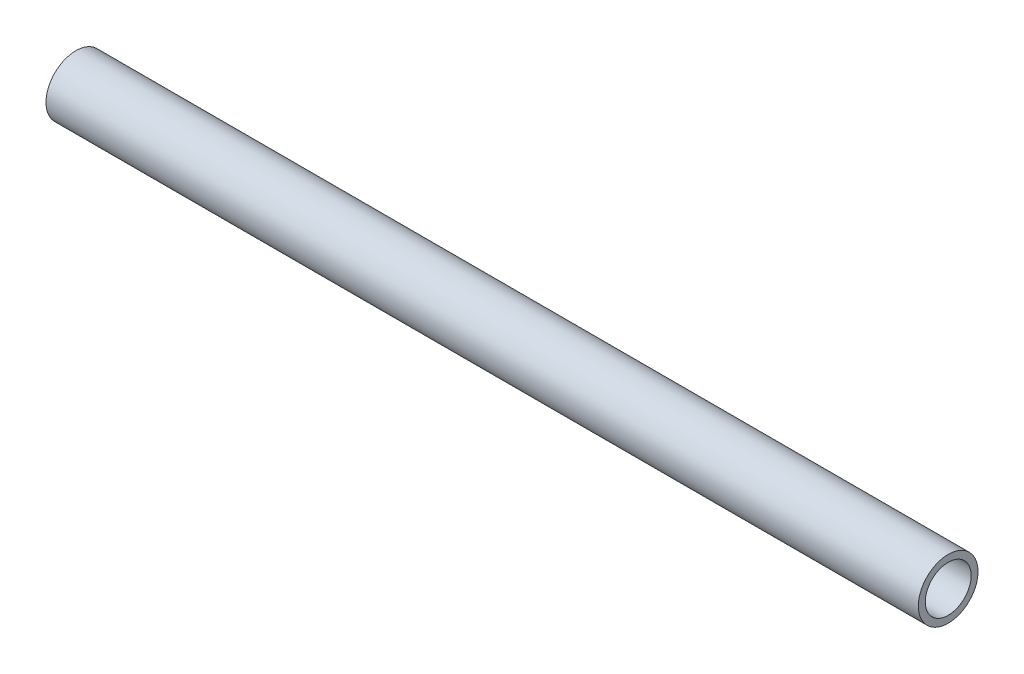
ISO-10303-21;
HEADER;
FILE_DESCRIPTION(('STEP AP214'),'2;1');
FILE_NAME('part.step','',(''),(''),'','','');
FILE_SCHEMA(('AUTOMOTIVE_DESIGN { 1 0 10303 214 1 1 1 1 }'));
ENDSEC;
DATA;
#1=APPLICATION_CONTEXT('core data for automotive mechanical design processes');
#2=APPLICATION_PROTOCOL_DEFINITION('international standard','automotive_design',2000,#1);
#3=PRODUCT_CONTEXT('',#1,'mechanical');
#4=PRODUCT('Part','Part','',(#3));
#5=PRODUCT_RELATED_PRODUCT_CATEGORY('part','',(#4));
#6=PRODUCT_DEFINITION_FORMATION('','',#4);
#7=PRODUCT_DEFINITION_CONTEXT('part definition',#1,'design');
#8=PRODUCT_DEFINITION('design','',#6,#7);
#9=PRODUCT_DEFINITION_SHAPE('','',#8);
#10=(LENGTH_UNIT() NAMED_UNIT(*) SI_UNIT(.MILLI.,.METRE.));
#11=(NAMED_UNIT(*) PLANE_ANGLE_UNIT() SI_UNIT($,.RADIAN.));
#12=(NAMED_UNIT(*) SI_UNIT($,.STERADIAN.) SOLID_ANGLE_UNIT());
#13=UNCERTAINTY_MEASURE_WITH_UNIT(LENGTH_MEASURE(1.E-05),#10,'distance_accuracy_value','');
#14=(GEOMETRIC_REPRESENTATION_CONTEXT(3) GLOBAL_UNCERTAINTY_ASSIGNED_CONTEXT((#13)) GLOBAL_UNIT_ASSIGNED_CONTEXT((#10,
#11,#12)) REPRESENTATION_CONTEXT('',''));
#15=CARTESIAN_POINT('',(0.,0.,0.));
#16=DIRECTION('',(0.,0.,1.));
#17=DIRECTION('',(1.,0.,0.));
#18=AXIS2_PLACEMENT_3D('',#15,#16,#17);
#19=CARTESIAN_POINT('',(482.6,0.,0.));
#20=DIRECTION('',(-1.,0.,0.));
#21=DIRECTION('',(0.,0.,1.));
#22=AXIS2_PLACEMENT_3D('',#19,#20,#21);
#23=CYLINDRICAL_SURFACE('',#22,12.7);
#24=CARTESIAN_POINT('',(482.6,0.,0.));
#25=DIRECTION('',(1.,0.,0.));
#26=DIRECTION('',(0.,0.,-1.));
#27=AXIS2_PLACEMENT_3D('',#24,#25,#26);
#28=CIRCLE('',#27,12.7);
#29=CARTESIAN_POINT('',(482.6,0.,12.7));
#30=VERTEX_POINT('',#29);
#31=EDGE_CURVE('E53',#30,#30,#28,.T.);
#32=CARTESIAN_POINT('',(0.,0.,0.));
#33=DIRECTION('',(1.,0.,0.));
#34=DIRECTION('',(0.,0.,-1.));
#35=AXIS2_PLACEMENT_3D('',#32,#33,#34);
#36=CIRCLE('',#35,12.7);
#37=CARTESIAN_POINT('',(0.,0.,12.7));
#38=VERTEX_POINT('',#37);
#39=EDGE_CURVE('E60',#38,#38,#36,.T.);
#40=CARTESIAN_POINT('',(482.6,0.,12.7));
#41=CARTESIAN_POINT('',(477.572916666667,0.,12.7));
#42=CARTESIAN_POINT('',(472.545833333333,0.,12.7));
#43=CARTESIAN_POINT('',(462.491666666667,0.,12.7));
#44=CARTESIAN_POINT('',(457.464583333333,0.,12.7));
#45=CARTESIAN_POINT('',(447.410416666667,0.,12.7));
#46=CARTESIAN_POINT('',(442.383333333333,0.,12.7));
#47=CARTESIAN_POINT('',(432.329166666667,0.,12.7));
#48=CARTESIAN_POINT('',(427.302083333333,0.,12.7));
#49=CARTESIAN_POINT('',(417.247916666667,0.,12.7));
#50=CARTESIAN_POINT('',(412.220833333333,0.,12.7));
#51=CARTESIAN_POINT('',(402.166666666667,0.,12.7));
#52=CARTESIAN_POINT('',(397.139583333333,0.,12.7));
#53=CARTESIAN_POINT('',(387.085416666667,0.,12.7));
#54=CARTESIAN_POINT('',(382.058333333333,0.,12.7));
#55=CARTESIAN_POINT('',(372.004166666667,0.,12.7));
#56=CARTESIAN_POINT('',(366.977083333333,0.,12.7));
#57=CARTESIAN_POINT('',(356.922916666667,0.,12.7));
#58=CARTESIAN_POINT('',(351.895833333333,0.,12.7));
#59=CARTESIAN_POINT('',(341.841666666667,0.,12.7));
#60=CARTESIAN_POINT('',(336.814583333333,0.,12.7));
#61=CARTESIAN_POINT('',(326.760416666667,0.,12.7));
#62=CARTESIAN_POINT('',(321.733333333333,0.,12.7));
#63=CARTESIAN_POINT('',(311.679166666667,0.,12.7));
#64=CARTESIAN_POINT('',(306.652083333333,0.,12.7));
#65=CARTESIAN_POINT('',(296.597916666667,0.,12.7));
#66=CARTESIAN_POINT('',(291.570833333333,0.,12.7));
#67=CARTESIAN_POINT('',(281.516666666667,0.,12.7));
#68=CARTESIAN_POINT('',(276.489583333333,0.,12.7));
#69=CARTESIAN_POINT('',(266.435416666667,0.,12.7));
#70=CARTESIAN_POINT('',(261.408333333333,0.,12.7));
#71=CARTESIAN_POINT('',(251.354166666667,0.,12.7));
#72=CARTESIAN_POINT('',(246.327083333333,0.,12.7));
#73=CARTESIAN_POINT('',(236.272916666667,0.,12.7));
#74=CARTESIAN_POINT('',(231.245833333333,0.,12.7));
#75=CARTESIAN_POINT('',(221.191666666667,0.,12.7));
#76=CARTESIAN_POINT('',(216.164583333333,0.,12.7));
#77=CARTESIAN_POINT('',(206.110416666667,0.,12.7));
#78=CARTESIAN_POINT('',(201.083333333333,0.,12.7));
#79=CARTESIAN_POINT('',(191.029166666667,0.,12.7));
#80=CARTESIAN_POINT('',(186.002083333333,0.,12.7));
#81=CARTESIAN_POINT('',(175.947916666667,0.,12.7));
#82=CARTESIAN_POINT('',(170.920833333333,0.,12.7));
#83=CARTESIAN_POINT('',(160.866666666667,0.,12.7));
#84=CARTESIAN_POINT('',(155.839583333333,0.,12.7));
#85=CARTESIAN_POINT('',(145.785416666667,0.,12.7));
#86=CARTESIAN_POINT('',(140.758333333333,0.,12.7));
#87=CARTESIAN_POINT('',(130.704166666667,0.,12.7));
#88=CARTESIAN_POINT('',(125.677083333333,0.,12.7));
#89=CARTESIAN_POINT('',(115.622916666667,0.,12.7));
#90=CARTESIAN_POINT('',(110.595833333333,0.,12.7));
#91=CARTESIAN_POINT('',(100.541666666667,0.,12.7));
#92=CARTESIAN_POINT('',(95.5145833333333,0.,12.7));
#93=CARTESIAN_POINT('',(85.4604166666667,0.,12.7));
#94=CARTESIAN_POINT('',(80.4333333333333,0.,12.7));
#95=CARTESIAN_POINT('',(70.3791666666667,0.,12.7));
#96=CARTESIAN_POINT('',(65.3520833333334,0.,12.7));
#97=CARTESIAN_POINT('',(55.2979166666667,0.,12.7));
#98=CARTESIAN_POINT('',(50.2708333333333,0.,12.7));
#99=CARTESIAN_POINT('',(40.2166666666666,0.,12.7));
#100=CARTESIAN_POINT('',(35.1895833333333,0.,12.7));
#101=CARTESIAN_POINT('',(25.1354166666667,0.,12.7));
#102=CARTESIAN_POINT('',(20.1083333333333,0.,12.7));
#103=CARTESIAN_POINT('',(10.0541666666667,0.,12.7));
#104=CARTESIAN_POINT('',(5.02708333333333,0.,12.7));
#105=CARTESIAN_POINT('',(0.,0.,12.7));
#106=B_SPLINE_CURVE_WITH_KNOTS('',3,(#40,#41,#42,#43,#44,#45,#46,#47,#48,#49,#50,#51,#52,#53,
#54,#55,#56,#57,#58,#59,#60,#61,#62,#63,#64,#65,#66,#67,#68,#69,#70,#71,#72,#73,#74,#75,#76,#77,
#78,#79,#80,#81,#82,#83,#84,#85,#86,#87,#88,#89,#90,#91,#92,#93,#94,#95,#96,#97,#98,#99,#100,
#101,#102,#103,#104,#105),.UNSPECIFIED.,.F.,.F.,(4,2,2,2,2,2,2,2,2,2,2,2,2,2,2,2,2,2,2,2,2,2,2,
2,2,2,2,2,2,2,2,2,4),(0.,15.08125,30.1625,45.24375,60.325,75.40625,90.4874999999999,105.56875,
120.65,135.73125,150.8125,165.89375,180.975,196.05625,211.1375,226.21875,241.3,256.38125,
271.4625,286.54375,301.625,316.70625,331.7875,346.86875,361.95,377.03125,392.1125,407.19375,
422.275,437.35625,452.4375,467.51875,482.6),.UNSPECIFIED.);
#107=EDGE_CURVE('BSEAM45',#30,#38,#106,.T.);
#108=ORIENTED_EDGE('',*,*,#31,.T.);
#109=ORIENTED_EDGE('',*,*,#39,.F.);
#110=ORIENTED_EDGE('',*,*,#107,.T.);
#111=ORIENTED_EDGE('',*,*,#107,.F.);
#112=EDGE_LOOP('',(#108,#110,#109,#111));
#113=FACE_BOUND('',#112,.T.);
#114=ADVANCED_FACE('F45',(#113),#23,.F.);
#115=CARTESIAN_POINT('',(482.6,0.,0.));
#116=DIRECTION('',(-1.,0.,0.));
#117=DIRECTION('',(0.,0.,1.));
#118=AXIS2_PLACEMENT_3D('',#115,#116,#117);
#119=CYLINDRICAL_SURFACE('',#118,16.51);
#120=CARTESIAN_POINT('',(482.6,0.,0.));
#121=DIRECTION('',(1.,0.,0.));
#122=DIRECTION('',(0.,0.,-1.));
#123=AXIS2_PLACEMENT_3D('',#120,#121,#122);
#124=CIRCLE('',#123,16.51);
#125=CARTESIAN_POINT('',(482.6,0.,16.51));
#126=VERTEX_POINT('',#125);
#127=EDGE_CURVE('E10',#126,#126,#124,.T.);
#128=CARTESIAN_POINT('',(0.,0.,0.));
#129=DIRECTION('',(1.,0.,0.));
#130=DIRECTION('',(0.,0.,-1.));
#131=AXIS2_PLACEMENT_3D('',#128,#129,#130);
#132=CIRCLE('',#131,16.51);
#133=CARTESIAN_POINT('',(0.,0.,16.51));
#134=VERTEX_POINT('',#133);
#135=EDGE_CURVE('E48',#134,#134,#132,.T.);
#136=CARTESIAN_POINT('',(482.6,0.,16.51));
#137=CARTESIAN_POINT('',(477.572916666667,0.,16.51));
#138=CARTESIAN_POINT('',(472.545833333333,0.,16.51));
#139=CARTESIAN_POINT('',(462.491666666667,0.,16.51));
#140=CARTESIAN_POINT('',(457.464583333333,0.,16.51));
#141=CARTESIAN_POINT('',(447.410416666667,0.,16.51));
#142=CARTESIAN_POINT('',(442.383333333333,0.,16.51));
#143=CARTESIAN_POINT('',(432.329166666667,0.,16.51));
#144=CARTESIAN_POINT('',(427.302083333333,0.,16.51));
#145=CARTESIAN_POINT('',(417.247916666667,0.,16.51));
#146=CARTESIAN_POINT('',(412.220833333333,0.,16.51));
#147=CARTESIAN_POINT('',(402.166666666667,0.,16.51));
#148=CARTESIAN_POINT('',(397.139583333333,0.,16.51));
#149=CARTESIAN_POINT('',(387.085416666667,0.,16.51));
#150=CARTESIAN_POINT('',(382.058333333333,0.,16.51));
#151=CARTESIAN_POINT('',(372.004166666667,0.,16.51));
#152=CARTESIAN_POINT('',(366.977083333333,0.,16.51));
#153=CARTESIAN_POINT('',(356.922916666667,0.,16.51));
#154=CARTESIAN_POINT('',(351.895833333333,0.,16.51));
#155=CARTESIAN_POINT('',(341.841666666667,0.,16.51));
#156=CARTESIAN_POINT('',(336.814583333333,0.,16.51));
#157=CARTESIAN_POINT('',(326.760416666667,0.,16.51));
#158=CARTESIAN_POINT('',(321.733333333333,0.,16.51));
#159=CARTESIAN_POINT('',(311.679166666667,0.,16.51));
#160=CARTESIAN_POINT('',(306.652083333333,0.,16.51));
#161=CARTESIAN_POINT('',(296.597916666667,0.,16.51));
#162=CARTESIAN_POINT('',(291.570833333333,0.,16.51));
#163=CARTESIAN_POINT('',(281.516666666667,0.,16.51));
#164=CARTESIAN_POINT('',(276.489583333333,0.,16.51));
#165=CARTESIAN_POINT('',(266.435416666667,0.,16.51));
#166=CARTESIAN_POINT('',(261.408333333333,0.,16.51));
#167=CARTESIAN_POINT('',(251.354166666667,0.,16.51));
#168=CARTESIAN_POINT('',(246.327083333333,0.,16.51));
#169=CARTESIAN_POINT('',(236.272916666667,0.,16.51));
#170=CARTESIAN_POINT('',(231.245833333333,0.,16.51));
#171=CARTESIAN_POINT('',(221.191666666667,0.,16.51));
#172=CARTESIAN_POINT('',(216.164583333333,0.,16.51));
#173=CARTESIAN_POINT('',(206.110416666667,0.,16.51));
#174=CARTESIAN_POINT('',(201.083333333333,0.,16.51));
#175=CARTESIAN_POINT('',(191.029166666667,0.,16.51));
#176=CARTESIAN_POINT('',(186.002083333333,0.,16.51));
#177=CARTESIAN_POINT('',(175.947916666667,0.,16.51));
#178=CARTESIAN_POINT('',(170.920833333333,0.,16.51));
#179=CARTESIAN_POINT('',(160.866666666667,0.,16.51));
#180=CARTESIAN_POINT('',(155.839583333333,0.,16.51));
#181=CARTESIAN_POINT('',(145.785416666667,0.,16.51));
#182=CARTESIAN_POINT('',(140.758333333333,0.,16.51));
#183=CARTESIAN_POINT('',(130.704166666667,0.,16.51));
#184=CARTESIAN_POINT('',(125.677083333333,0.,16.51));
#185=CARTESIAN_POINT('',(115.622916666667,0.,16.51));
#186=CARTESIAN_POINT('',(110.595833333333,0.,16.51));
#187=CARTESIAN_POINT('',(100.541666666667,0.,16.51));
#188=CARTESIAN_POINT('',(95.5145833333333,0.,16.51));
#189=CARTESIAN_POINT('',(85.4604166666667,0.,16.51));
#190=CARTESIAN_POINT('',(80.4333333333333,0.,16.51));
#191=CARTESIAN_POINT('',(70.3791666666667,0.,16.51));
#192=CARTESIAN_POINT('',(65.3520833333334,0.,16.51));
#193=CARTESIAN_POINT('',(55.2979166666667,0.,16.51));
#194=CARTESIAN_POINT('',(50.2708333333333,0.,16.51));
#195=CARTESIAN_POINT('',(40.2166666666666,0.,16.51));
#196=CARTESIAN_POINT('',(35.1895833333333,0.,16.51));
#197=CARTESIAN_POINT('',(25.1354166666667,0.,16.51));
#198=CARTESIAN_POINT('',(20.1083333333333,0.,16.51));
#199=CARTESIAN_POINT('',(10.0541666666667,0.,16.51));
#200=CARTESIAN_POINT('',(5.02708333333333,0.,16.51));
#201=CARTESIAN_POINT('',(0.,0.,16.51));
#202=B_SPLINE_CURVE_WITH_KNOTS('',3,(#136,#137,#138,#139,#140,#141,#142,#143,#144,#145,#146,
#147,#148,#149,#150,#151,#152,#153,#154,#155,#156,#157,#158,#159,#160,#161,#162,#163,#164,#165,
#166,#167,#168,#169,#170,#171,#172,#173,#174,#175,#176,#177,#178,#179,#180,#181,#182,#183,#184,
#185,#186,#187,#188,#189,#190,#191,#192,#193,#194,#195,#196,#197,#198,#199,#200,#201),
.UNSPECIFIED.,.F.,.F.,(4,2,2,2,2,2,2,2,2,2,2,2,2,2,2,2,2,2,2,2,2,2,2,2,2,2,2,2,2,2,2,2,4),(0.,
15.08125,30.1625,45.24375,60.325,75.40625,90.4874999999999,105.56875,120.65,135.73125,150.8125,
165.89375,180.975,196.05625,211.1375,226.21875,241.3,256.38125,271.4625,286.54375,301.625,
316.70625,331.7875,346.86875,361.95,377.03125,392.1125,407.19375,422.275,437.35625,452.4375,
467.51875,482.6),.UNSPECIFIED.);
#203=EDGE_CURVE('BSEAM69',#126,#134,#202,.T.);
#204=ORIENTED_EDGE('',*,*,#127,.F.);
#205=ORIENTED_EDGE('',*,*,#135,.T.);
#206=ORIENTED_EDGE('',*,*,#203,.T.);
#207=ORIENTED_EDGE('',*,*,#203,.F.);
#208=EDGE_LOOP('',(#204,#206,#205,#207));
#209=FACE_BOUND('',#208,.T.);
#210=ADVANCED_FACE('F69',(#209),#119,.T.);
#211=CARTESIAN_POINT('',(482.6,0.,0.));
#212=DIRECTION('',(1.,0.,0.));
#213=DIRECTION('',(0.,0.,-1.));
#214=AXIS2_PLACEMENT_3D('',#211,#212,#213);
#215=PLANE('',#214);
#216=ORIENTED_EDGE('',*,*,#31,.F.);
#217=EDGE_LOOP('',(#216));
#218=FACE_BOUND('',#217,.T.);
#219=ORIENTED_EDGE('',*,*,#127,.T.);
#220=EDGE_LOOP('',(#219));
#221=FACE_BOUND('',#220,.T.);
#222=ADVANCED_FACE('F73',(#218,#221),#215,.T.);
#223=CARTESIAN_POINT('',(0.,0.,0.));
#224=DIRECTION('',(1.,0.,0.));
#225=DIRECTION('',(0.,0.,-1.));
#226=AXIS2_PLACEMENT_3D('',#223,#224,#225);
#227=PLANE('',#226);
#228=ORIENTED_EDGE('',*,*,#39,.T.);
#229=EDGE_LOOP('',(#228));
#230=FACE_BOUND('',#229,.T.);
#231=ORIENTED_EDGE('',*,*,#135,.F.);
#232=EDGE_LOOP('',(#231));
#233=FACE_BOUND('',#232,.T.);
#234=ADVANCED_FACE('F71',(#230,#233),#227,.F.);
#235=CLOSED_SHELL('',(#114,#210,#222,#234));
#236=MANIFOLD_SOLID_BREP('B2',#235);
#237=ADVANCED_BREP_SHAPE_REPRESENTATION('',(#18,#236),#14);
#238=SHAPE_DEFINITION_REPRESENTATION(#9,#237);
ENDSEC;
END-ISO-10303-21;
